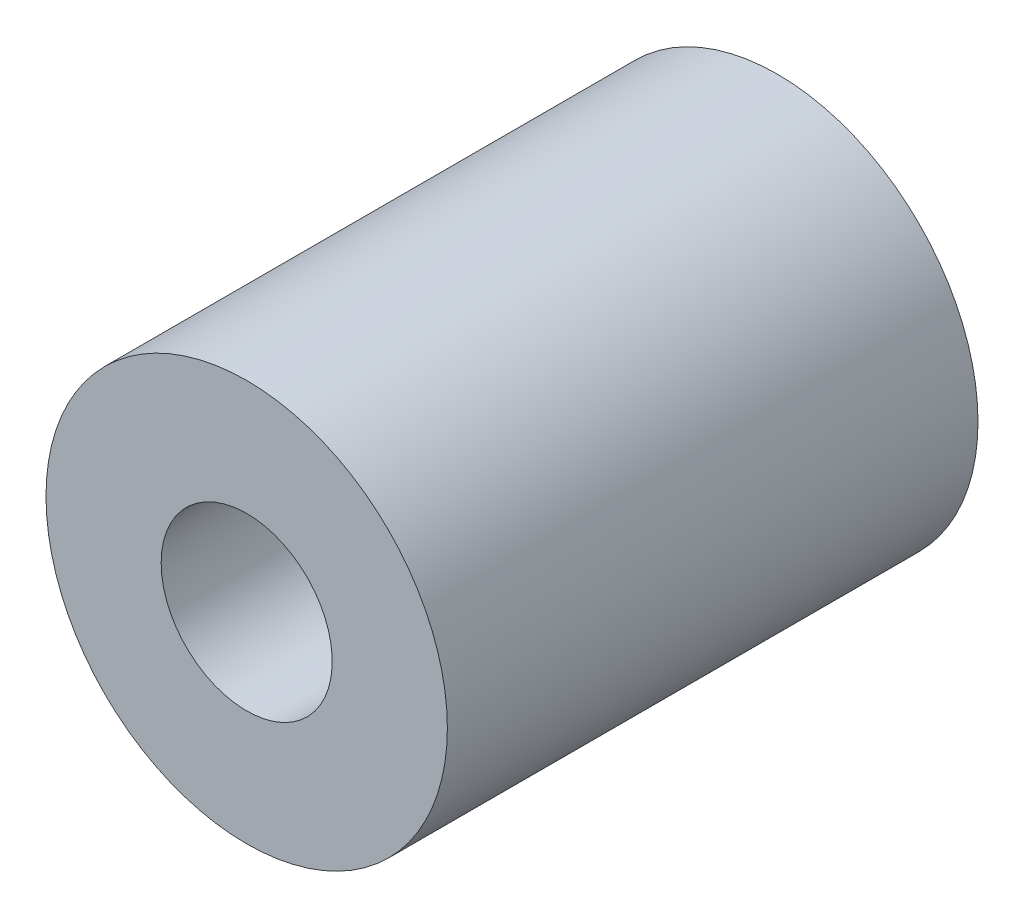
from build123d import *

# Parameters (mm, degrees)
SKETCH2_R           = 9.3853
SKETCH2_R_2         = 4
BOSS_EXTRUDE1_DEPTH = 24.8158


with BuildPart() as part:
    # Sketch2 → Boss-Extrude1 (new body)
    with BuildSketch(Plane.XY):
        with Locations(Location((0, 0, 0), (0, 0, 180))):
            Circle(SKETCH2_R)
        with Locations(Location((0, 0, 0), (0, 0, 180))):
            Circle(SKETCH2_R_2, mode=Mode.SUBTRACT)
    extrude(amount=BOSS_EXTRUDE1_DEPTH)


solid = part.part
